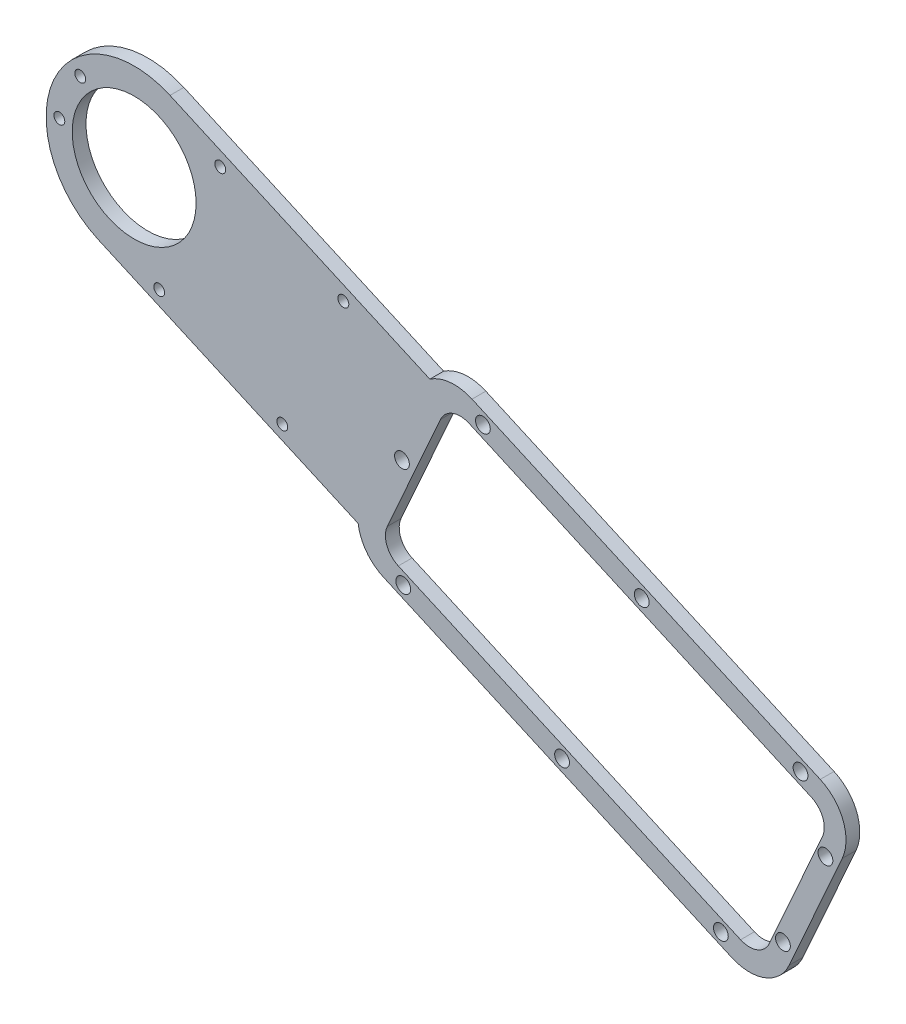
from build123d import *

# Parameters (mm, degrees)
SKETCH1_R           = 1.7
SKETCH1_R_2         = 14.25
SKETCH1_R_3         = 1.25
BOSS_EXTRUDE1_DEPTH = 3.175


with BuildPart() as part:
    # Sketch1 → Boss-Extrude1 (new body)
    with BuildSketch(Plane(origin=(0, 0, 0), x_dir=(-1, 0, 0), z_dir=(0, 0, -1))):
        with BuildLine():
            Line((67.653220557, 77.632201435), (79.867786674, 50.231391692))
            ThreePointArc((79.867786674, 50.231391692), (85.421957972, 44.965480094), (93.072911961, 45.169310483))
            Line((93.072911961, 45.169310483), (173.174612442, 80.876558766))
            ThreePointArc((173.174612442, 80.876558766), (177.109561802, 84.018800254), (179.014269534, 88.680301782))
            Line((179.014269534, 88.680301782), (238.78902448, 115.326328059))
            ThreePointArc((238.78902448, 115.326328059), (249.039738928, 142.066706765), (222.299360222, 152.317421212))
            Line((222.299360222, 152.317421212), (162.524605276, 125.671394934))
            ThreePointArc((162.524605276, 125.671394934), (157.784388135, 127.370762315), (152.817002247, 126.544575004))
            Line((152.817002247, 126.544575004), (72.715301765, 90.837326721))
            ThreePointArc((72.715301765, 90.837326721), (67.449390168, 85.283155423), (67.653220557, 77.632201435))
        make_face()
        with Locations(Location((168.932649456, 106.357056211, 0), (0, 0, 180))):
            Circle(SKETCH1_R, mode=Mode.SUBTRACT)
        with Locations(Location((71.52342211, 76.072861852, 0), (0, 0, 180))):
            Circle(SKETCH1_R, mode=Mode.SUBTRACT)
        with Locations(Location((81.295075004, 54.152214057, 0), (0, 0, 180))):
            Circle(SKETCH1_R, mode=Mode.SUBTRACT)
        with Locations(Location((77.249619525, 90.121461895, 0), (0, 0, 180))):
            Circle(SKETCH1_R, mode=Mode.SUBTRACT)
        with Locations(Location((113.784032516, 106.407550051, 0), (0, 0, 180))):
            Circle(SKETCH1_R, mode=Mode.SUBTRACT)
        with Locations(Location((150.318445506, 122.693638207, 0), (0, 0, 180))):
            Circle(SKETCH1_R, mode=Mode.SUBTRACT)
        with Locations(Location((168.640294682, 81.592423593, 0), (0, 0, 180))):
            Circle(SKETCH1_R, mode=Mode.SUBTRACT)
        with Locations(Location((132.105881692, 65.306335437, 0), (0, 0, 180))):
            Circle(SKETCH1_R, mode=Mode.SUBTRACT)
        with Locations(Location((95.571468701, 49.02024728, 0), (0, 0, 180))):
            Circle(SKETCH1_R, mode=Mode.SUBTRACT)
        with Locations(Location((230.544192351, 133.821874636, 0), (0, 0, 180))):
            Circle(SKETCH1_R_2, mode=Mode.SUBTRACT)
        with Locations(Location((196.466353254, 99.744559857, 0), (0, 0, 180))):
            Circle(SKETCH1_R_3, mode=Mode.SUBTRACT)
        with Locations(Location((224.780523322, 112.366278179, 0), (0, 0, 180))):
            Circle(SKETCH1_R_3, mode=Mode.SUBTRACT)
        with Locations(Location((210.733772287, 143.877209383, 0), (0, 0, 180))):
            Circle(SKETCH1_R_3, mode=Mode.SUBTRACT)
        with Locations(Location((182.419602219, 131.255491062, 0), (0, 0, 180))):
            Circle(SKETCH1_R_3, mode=Mode.SUBTRACT)
        with Locations(Location((242.947351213, 145.810375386, 0), (0, 0, 180))):
            Circle(SKETCH1_R_3, mode=Mode.SUBTRACT)
        with Locations(Location((247.751623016, 135.033002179, 0), (0, 0, 180))):
            Circle(SKETCH1_R_3, mode=Mode.SUBTRACT)
        with BuildLine():
            Line((74.751062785, 86.270525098), (153.492790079, 121.371532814))
            ThreePointArc((153.492790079, 121.371532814), (157.318267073, 121.473448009), (160.095352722, 118.84049221))
            Line((160.095352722, 118.84049221), (172.30991884, 91.439682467))
            ThreePointArc((172.30991884, 91.439682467), (172.411834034, 87.614205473), (169.778878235, 84.837119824))
            Line((169.778878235, 84.837119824), (91.037150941, 49.736112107))
            ThreePointArc((91.037150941, 49.736112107), (87.211673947, 49.634196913), (84.434588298, 52.267152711))
            Line((84.434588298, 52.267152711), (72.22002218, 79.667962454))
            ThreePointArc((72.22002218, 79.667962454), (72.118106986, 83.493439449), (74.751062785, 86.270525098))
        make_face(mode=Mode.SUBTRACT)
    extrude(amount=-BOSS_EXTRUDE1_DEPTH)


solid = part.part
